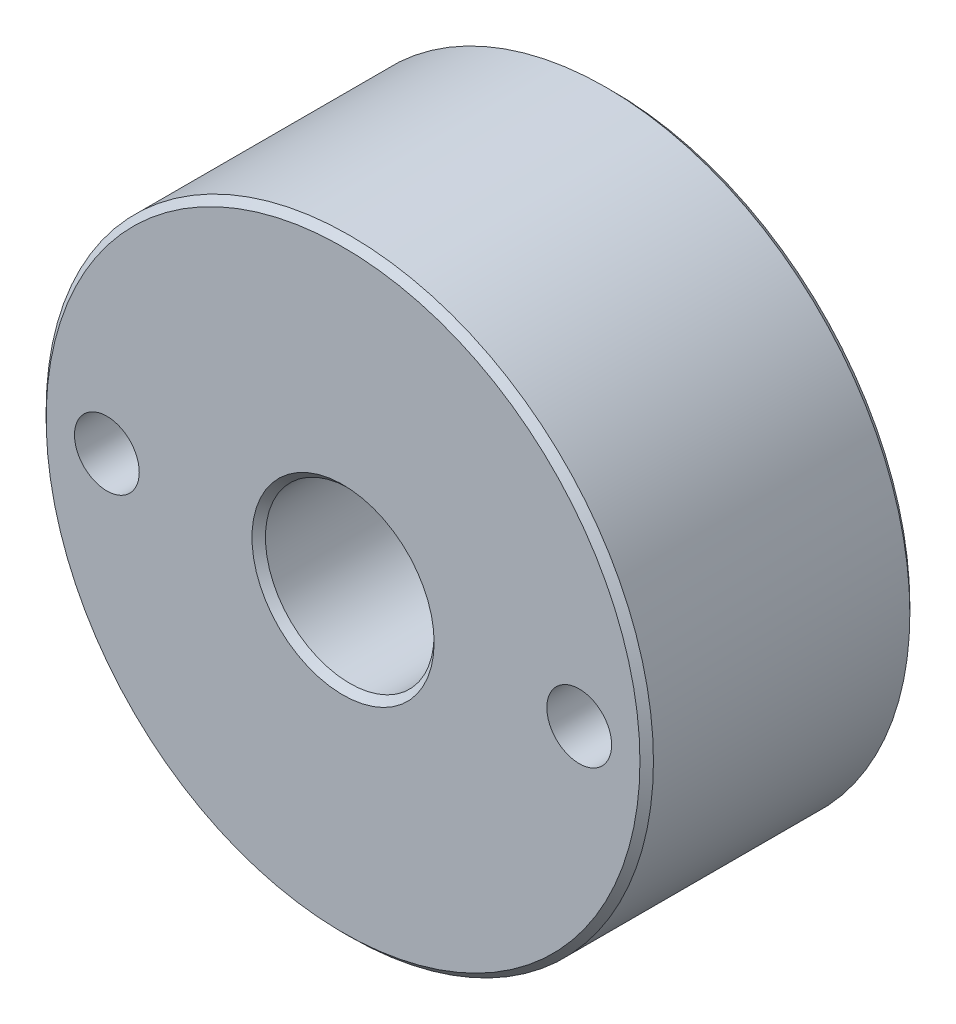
from build123d import *

# Parameters (mm, degrees)
ESQUISSE1_R           = 22.5
ESQUISSE1_R_2         = 6.25
EXTRUSION1_DEPTH      = 20
TROU_TARAUD_M6X1_02_D = 4.8
CHANFREIN2_SIZE       = 0.5


with BuildPart() as part:
    # Esquisse1 → Extrusion1 (new body)
    with BuildSketch(Plane.XY):
        Circle(ESQUISSE1_R)
        Circle(ESQUISSE1_R_2, mode=Mode.SUBTRACT)
    extrude(amount=EXTRUSION1_DEPTH)

    # Trou taraud_ M6x1.02 (through all)
    with Locations(Plane.XY.offset(20)):
        with Locations((-17.5, 0), (17.5, 0)):
            Hole(TROU_TARAUD_M6X1_02_D / 2)

    # Chanfrein2
    chanfrein2_edges = [part.edges().sort_by_distance(p)[0] for p in [
        (-22.5, 0, 0),
        (-22.5, 0, 20),
        (-6.25, 0, 0),
        (-6.25, 0, 20),
    ]]
    chamfer(chanfrein2_edges, length=CHANFREIN2_SIZE)


solid = part.part
